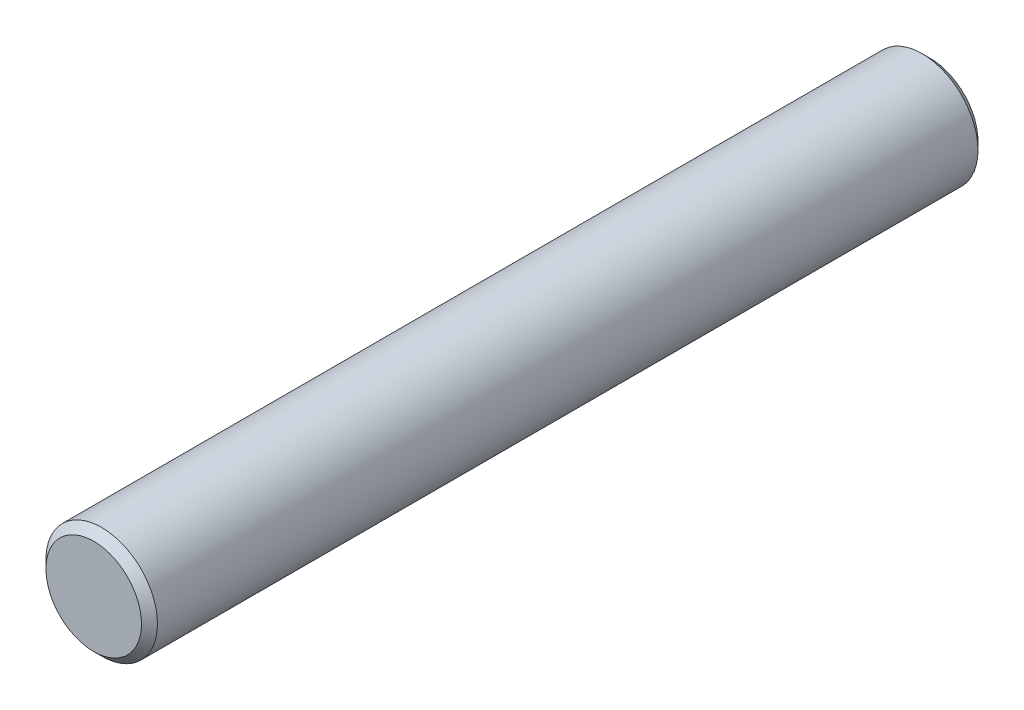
ISO-10303-21;
HEADER;
FILE_DESCRIPTION(('STEP AP214'),'2;1');
FILE_NAME('part.step','',(''),(''),'','','');
FILE_SCHEMA(('AUTOMOTIVE_DESIGN { 1 0 10303 214 1 1 1 1 }'));
ENDSEC;
DATA;
#1=APPLICATION_CONTEXT('core data for automotive mechanical design processes');
#2=APPLICATION_PROTOCOL_DEFINITION('international standard','automotive_design',2000,#1);
#3=PRODUCT_CONTEXT('',#1,'mechanical');
#4=PRODUCT('Part','Part','',(#3));
#5=PRODUCT_RELATED_PRODUCT_CATEGORY('part','',(#4));
#6=PRODUCT_DEFINITION_FORMATION('','',#4);
#7=PRODUCT_DEFINITION_CONTEXT('part definition',#1,'design');
#8=PRODUCT_DEFINITION('design','',#6,#7);
#9=PRODUCT_DEFINITION_SHAPE('','',#8);
#10=(LENGTH_UNIT() NAMED_UNIT(*) SI_UNIT(.MILLI.,.METRE.));
#11=(NAMED_UNIT(*) PLANE_ANGLE_UNIT() SI_UNIT($,.RADIAN.));
#12=(NAMED_UNIT(*) SI_UNIT($,.STERADIAN.) SOLID_ANGLE_UNIT());
#13=UNCERTAINTY_MEASURE_WITH_UNIT(LENGTH_MEASURE(1.E-05),#10,'distance_accuracy_value','');
#14=(GEOMETRIC_REPRESENTATION_CONTEXT(3) GLOBAL_UNCERTAINTY_ASSIGNED_CONTEXT((#13)) GLOBAL_UNIT_ASSIGNED_CONTEXT((#10,
#11,#12)) REPRESENTATION_CONTEXT('',''));
#15=CARTESIAN_POINT('',(0.,0.,0.));
#16=DIRECTION('',(0.,0.,1.));
#17=DIRECTION('',(1.,0.,0.));
#18=AXIS2_PLACEMENT_3D('',#15,#16,#17);
#19=CARTESIAN_POINT('',(0.,0.,210.));
#20=DIRECTION('',(0.,0.,-1.));
#21=DIRECTION('',(-1.,0.,0.));
#22=AXIS2_PLACEMENT_3D('',#19,#20,#21);
#23=CYLINDRICAL_SURFACE('',#22,14.);
#24=CARTESIAN_POINT('',(0.,0.,1.99999999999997));
#25=DIRECTION('',(0.,0.,1.));
#26=DIRECTION('',(1.,0.,0.));
#27=AXIS2_PLACEMENT_3D('',#24,#25,#26);
#28=CIRCLE('',#27,14.);
#29=CARTESIAN_POINT('',(14.,0.,1.99999999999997));
#30=VERTEX_POINT('',#29);
#31=EDGE_CURVE('E37',#30,#30,#28,.T.);
#32=ORIENTED_EDGE('',*,*,#31,.T.);
#33=EDGE_LOOP('',(#32));
#34=FACE_BOUND('',#33,.T.);
#35=CARTESIAN_POINT('',(0.,0.,208.));
#36=DIRECTION('',(0.,0.,1.));
#37=DIRECTION('',(1.,0.,0.));
#38=AXIS2_PLACEMENT_3D('',#35,#36,#37);
#39=CIRCLE('',#38,14.);
#40=CARTESIAN_POINT('',(14.,0.,208.));
#41=VERTEX_POINT('',#40);
#42=EDGE_CURVE('E41',#41,#41,#39,.F.);
#43=ORIENTED_EDGE('',*,*,#42,.T.);
#44=EDGE_LOOP('',(#43));
#45=FACE_BOUND('',#44,.T.);
#46=ADVANCED_FACE('F27',(#34,#45),#23,.T.);
#47=CARTESIAN_POINT('',(0.,0.,210.));
#48=DIRECTION('',(0.,0.,1.));
#49=DIRECTION('',(1.,0.,0.));
#50=AXIS2_PLACEMENT_3D('',#47,#48,#49);
#51=PLANE('',#50);
#52=CARTESIAN_POINT('',(0.,0.,210.));
#53=DIRECTION('',(0.,0.,1.));
#54=DIRECTION('',(1.,0.,0.));
#55=AXIS2_PLACEMENT_3D('',#52,#53,#54);
#56=CIRCLE('',#55,12.);
#57=CARTESIAN_POINT('',(12.,0.,210.));
#58=VERTEX_POINT('',#57);
#59=EDGE_CURVE('E10',#58,#58,#56,.T.);
#60=ORIENTED_EDGE('',*,*,#59,.T.);
#61=EDGE_LOOP('',(#60));
#62=FACE_BOUND('',#61,.T.);
#63=ADVANCED_FACE('F60',(#62),#51,.T.);
#64=CARTESIAN_POINT('',(0.,0.,0.));
#65=DIRECTION('',(0.,0.,1.));
#66=DIRECTION('',(1.,0.,0.));
#67=AXIS2_PLACEMENT_3D('',#64,#65,#66);
#68=PLANE('',#67);
#69=CARTESIAN_POINT('',(0.,0.,0.));
#70=DIRECTION('',(0.,0.,1.));
#71=DIRECTION('',(1.,0.,0.));
#72=AXIS2_PLACEMENT_3D('',#69,#70,#71);
#73=CIRCLE('',#72,12.);
#74=CARTESIAN_POINT('',(12.,0.,0.));
#75=VERTEX_POINT('',#74);
#76=EDGE_CURVE('E33',#75,#75,#73,.F.);
#77=ORIENTED_EDGE('',*,*,#76,.T.);
#78=EDGE_LOOP('',(#77));
#79=FACE_BOUND('',#78,.T.);
#80=ADVANCED_FACE('F56',(#79),#68,.F.);
#81=CARTESIAN_POINT('',(0.,0.,1.99999999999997));
#82=DIRECTION('',(0.,0.,1.));
#83=DIRECTION('',(1.,0.,0.));
#84=AXIS2_PLACEMENT_3D('',#81,#82,#83);
#85=CONICAL_SURFACE('',#84,14.,0.785398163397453);
#86=ORIENTED_EDGE('',*,*,#76,.F.);
#87=EDGE_LOOP('',(#86));
#88=FACE_BOUND('',#87,.T.);
#89=ORIENTED_EDGE('',*,*,#31,.F.);
#90=EDGE_LOOP('',(#89));
#91=FACE_BOUND('',#90,.T.);
#92=ADVANCED_FACE('F51',(#88,#91),#85,.T.);
#93=CARTESIAN_POINT('',(0.,0.,210.));
#94=DIRECTION('',(0.,0.,-1.));
#95=DIRECTION('',(-1.,0.,0.));
#96=AXIS2_PLACEMENT_3D('',#93,#94,#95);
#97=CONICAL_SURFACE('',#96,12.,0.785398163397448);
#98=ORIENTED_EDGE('',*,*,#42,.F.);
#99=EDGE_LOOP('',(#98));
#100=FACE_BOUND('',#99,.T.);
#101=ORIENTED_EDGE('',*,*,#59,.F.);
#102=EDGE_LOOP('',(#101));
#103=FACE_BOUND('',#102,.T.);
#104=ADVANCED_FACE('F48',(#100,#103),#97,.T.);
#105=CLOSED_SHELL('',(#46,#63,#80,#92,#104));
#106=MANIFOLD_SOLID_BREP('B2',#105);
#107=ADVANCED_BREP_SHAPE_REPRESENTATION('',(#18,#106),#14);
#108=SHAPE_DEFINITION_REPRESENTATION(#9,#107);
ENDSEC;
END-ISO-10303-21;
